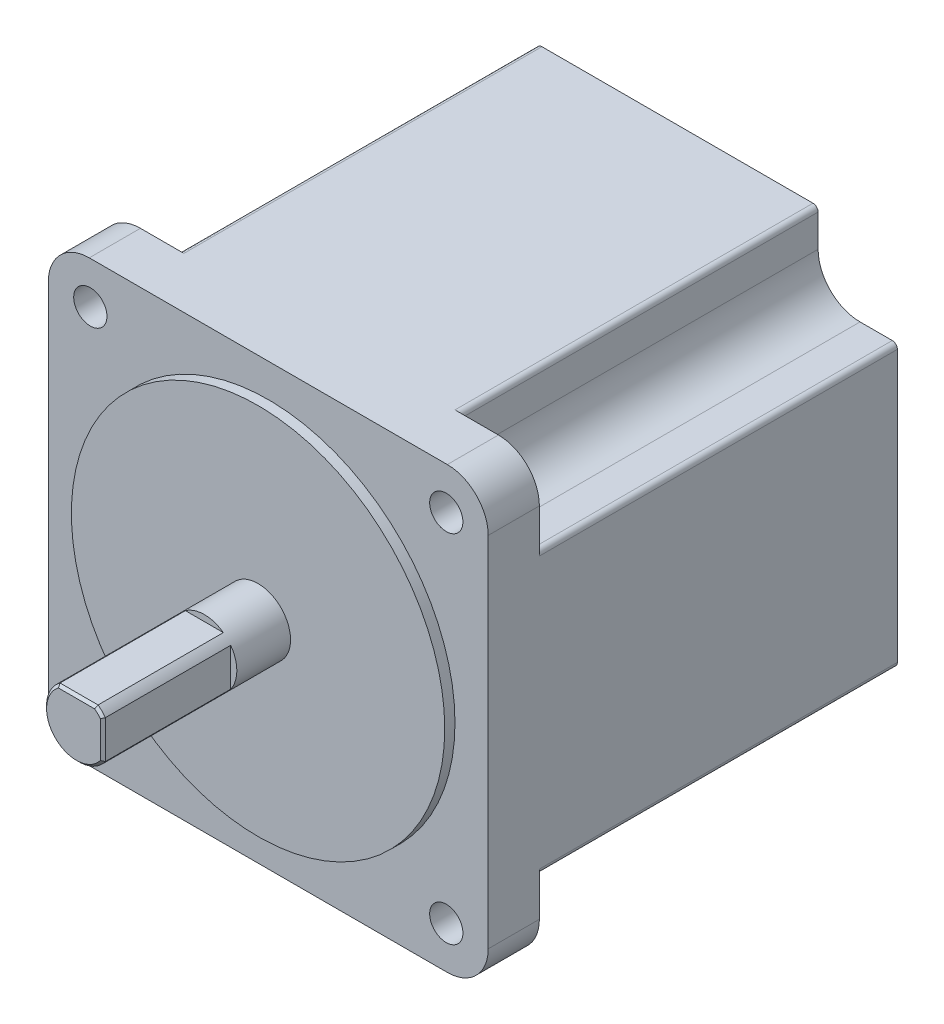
from build123d import *

# Parameters (mm, degrees)
SKETCH_1_R          = 36.5
EXTRUDE_1_DEPTH     = 2
SKETCH_2_R          = 6.35
EXTRUDE_2_DEPTH     = 35.5
CUT_EXTRUDE_1_DEPTH = 25
SKETCH_4_R          = 3.25
EXTRUDE_3_DEPTH     = 80
CUT_EXTRUDE_2_DEPTH = 70
CHAMFER_1_SIZE      = 0.5


with BuildPart() as part:
    # Sketch 1 → Extrude 1 (new body)
    with BuildSketch(Plane.XY):
        Circle(SKETCH_1_R)
    extrude(amount=-EXTRUDE_1_DEPTH)

    # Sketch 2 → Extrude 2 (add)
    with BuildSketch(Plane.XY):
        Circle(SKETCH_2_R)
    extrude(amount=EXTRUDE_2_DEPTH)

    # Sketch 3 → Cut-Extrude 1 (cut)
    with BuildSketch(Plane.XY.offset(35.5)):
        Polygon((0, 5.15), (4.738075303, 5.15), (4.738075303, 8.76543931), (-5.401405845, 8.76543931), (-5.401405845, 5.15), align=None)
        Polygon((5.15, 0), (5.15, -5.069740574), (9.191866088, -5.069740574), (9.191866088, 4.406410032), (5.15, 4.406410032), align=None)
    extrude(amount=-CUT_EXTRUDE_1_DEPTH, mode=Mode.SUBTRACT)

    # Sketch 4 → Extrude 3 (add)
    with BuildSketch(Plane(origin=(0, 0, -2), x_dir=(-1, 0, 0), z_dir=(0, 0, -1))):
        with BuildLine():
            Line((0, 43), (35, 43))
            ThreePointArc((35, 43), (40.656854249, 40.656854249), (43, 35))
            Line((43, 35), (43, -35))
            ThreePointArc((43, -35), (40.656854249, -40.656854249), (35, -43))
            Line((35, -43), (-35, -43))
            ThreePointArc((-35, -43), (-40.656854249, -40.656854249), (-43, -35))
            Line((-43, -35), (-43, 35))
            ThreePointArc((-43, 35), (-40.656854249, 40.656854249), (-35, 43))
            Line((-35, 43), (0, 43))
        make_face()
        with Locations((-34.8, 34.8)):
            Circle(SKETCH_4_R, mode=Mode.SUBTRACT)
        with Locations((34.8, 34.8)):
            Circle(SKETCH_4_R, mode=Mode.SUBTRACT)
        with Locations((34.8, -34.8)):
            Circle(SKETCH_4_R, mode=Mode.SUBTRACT)
        with Locations((-34.8, -34.8)):
            Circle(SKETCH_4_R, mode=Mode.SUBTRACT)
    extrude(amount=EXTRUDE_3_DEPTH)

    # Sketch 5 → Cut-Extrude 2 (cut)
    with BuildSketch(Plane(origin=(0, 0, -82), x_dir=(-1, 0, 0), z_dir=(0, 0, -1))):
        with BuildLine():
            Line((13.75, 43), (26.5, 43))
            ThreePointArc((26.5, 43), (27.207106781, 42.707106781), (27.5, 42))
            Line((27.5, 42), (27.5, 35.7))
            ThreePointArc((27.5, 35.7), (29.901724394, 29.901724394), (35.7, 27.5))
            Line((35.7, 27.5), (42, 27.5))
            ThreePointArc((42, 27.5), (42.707106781, 27.207106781), (43, 26.5))
            Line((43, 26.5), (43, 18.140986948))
            Line((43, 18.140986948), (50.571489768, 18.140986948))
            Line((50.571489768, 18.140986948), (50.571489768, 56.827618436))
            Line((50.571489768, 56.827618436), (13.75, 56.827618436))
            Line((13.75, 56.827618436), (13.75, 43))
        make_face()
        with BuildLine():
            Line((-13.75, 56.827618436), (-13.75, 43))
            Line((-13.75, 43), (-26.5, 43))
            ThreePointArc((-26.5, 43), (-27.207106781, 42.707106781), (-27.5, 42))
            Line((-27.5, 42), (-27.5, 35.7))
            ThreePointArc((-27.5, 35.7), (-29.901724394, 29.901724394), (-35.7, 27.5))
            Line((-35.7, 27.5), (-42, 27.5))
            ThreePointArc((-42, 27.5), (-42.707106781, 27.207106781), (-43, 26.5))
            Line((-43, 26.5), (-43, 18.140986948))
            Line((-43, 18.140986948), (-50.571489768, 18.140986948))
            Line((-50.571489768, 18.140986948), (-50.571489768, 56.827618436))
            Line((-50.571489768, 56.827618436), (-13.75, 56.827618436))
        make_face()
        with BuildLine():
            Line((13.75, -56.827618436), (13.75, -43))
            Line((13.75, -43), (26.5, -43))
            ThreePointArc((26.5, -43), (27.207106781, -42.707106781), (27.5, -42))
            Line((27.5, -42), (27.5, -35.7))
            ThreePointArc((27.5, -35.7), (29.901724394, -29.901724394), (35.7, -27.5))
            Line((35.7, -27.5), (42, -27.5))
            ThreePointArc((42, -27.5), (42.707106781, -27.207106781), (43, -26.5))
            Line((43, -26.5), (43, -18.140986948))
            Line((43, -18.140986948), (50.571489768, -18.140986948))
            Line((50.571489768, -18.140986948), (50.571489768, -56.827618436))
            Line((50.571489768, -56.827618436), (13.75, -56.827618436))
        make_face()
        with BuildLine():
            Line((-13.75, -43), (-26.5, -43))
            ThreePointArc((-26.5, -43), (-27.207106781, -42.707106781), (-27.5, -42))
            Line((-27.5, -42), (-27.5, -35.7))
            ThreePointArc((-27.5, -35.7), (-29.901724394, -29.901724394), (-35.7, -27.5))
            Line((-35.7, -27.5), (-42, -27.5))
            ThreePointArc((-42, -27.5), (-42.707106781, -27.207106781), (-43, -26.5))
            Line((-43, -26.5), (-43, -18.140986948))
            Line((-43, -18.140986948), (-50.571489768, -18.140986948))
            Line((-50.571489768, -18.140986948), (-50.571489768, -56.827618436))
            Line((-50.571489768, -56.827618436), (-13.75, -56.827618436))
            Line((-13.75, -56.827618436), (-13.75, -43))
        make_face()
    extrude(amount=-CUT_EXTRUDE_2_DEPTH, mode=Mode.SUBTRACT)

    # Chamfer 1
    chamfer_1_edges = [part.edges().sort_by_distance(p)[0] for p in [
        (0, 5.15, 35.5),
        (4.490128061, 4.490128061, 35.5),
        (5.15, 0, 35.5),
        (-4.490128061, -4.490128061, 35.5),
    ]]
    chamfer(chamfer_1_edges, length=CHAMFER_1_SIZE)


solid = part.part
